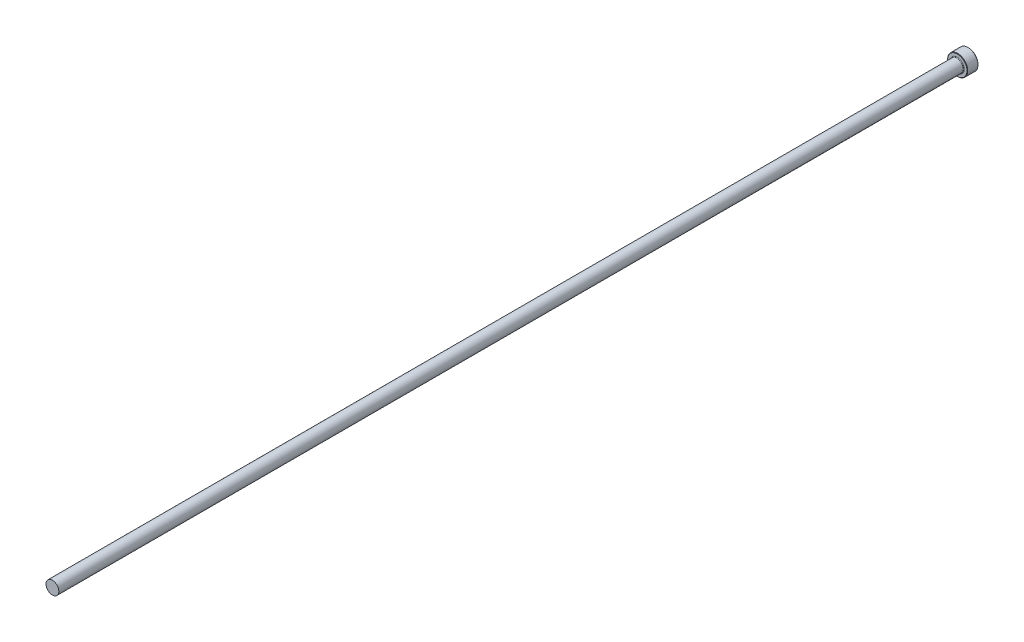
ISO-10303-21;
HEADER;
FILE_DESCRIPTION(('STEP AP214'),'2;1');
FILE_NAME('part.step','',(''),(''),'','','');
FILE_SCHEMA(('AUTOMOTIVE_DESIGN { 1 0 10303 214 1 1 1 1 }'));
ENDSEC;
DATA;
#1=APPLICATION_CONTEXT('core data for automotive mechanical design processes');
#2=APPLICATION_PROTOCOL_DEFINITION('international standard','automotive_design',2000,#1);
#3=PRODUCT_CONTEXT('',#1,'mechanical');
#4=PRODUCT('Part','Part','',(#3));
#5=PRODUCT_RELATED_PRODUCT_CATEGORY('part','',(#4));
#6=PRODUCT_DEFINITION_FORMATION('','',#4);
#7=PRODUCT_DEFINITION_CONTEXT('part definition',#1,'design');
#8=PRODUCT_DEFINITION('design','',#6,#7);
#9=PRODUCT_DEFINITION_SHAPE('','',#8);
#10=(LENGTH_UNIT() NAMED_UNIT(*) SI_UNIT(.MILLI.,.METRE.));
#11=(NAMED_UNIT(*) PLANE_ANGLE_UNIT() SI_UNIT($,.RADIAN.));
#12=(NAMED_UNIT(*) SI_UNIT($,.STERADIAN.) SOLID_ANGLE_UNIT());
#13=UNCERTAINTY_MEASURE_WITH_UNIT(LENGTH_MEASURE(1.E-05),#10,'distance_accuracy_value','');
#14=(GEOMETRIC_REPRESENTATION_CONTEXT(3) GLOBAL_UNCERTAINTY_ASSIGNED_CONTEXT((#13)) GLOBAL_UNIT_ASSIGNED_CONTEXT((#10,
#11,#12)) REPRESENTATION_CONTEXT('',''));
#15=CARTESIAN_POINT('',(0.,0.,0.));
#16=DIRECTION('',(0.,0.,1.));
#17=DIRECTION('',(1.,0.,0.));
#18=AXIS2_PLACEMENT_3D('',#15,#16,#17);
#19=CARTESIAN_POINT('',(0.,3.49999999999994,500.));
#20=DIRECTION('',(0.,0.,-1.));
#21=DIRECTION('',(-1.,0.,0.));
#22=AXIS2_PLACEMENT_3D('',#19,#20,#21);
#23=PLANE('',#22);
#24=CARTESIAN_POINT('',(0.,0.,500.));
#25=DIRECTION('',(0.,0.,1.));
#26=DIRECTION('',(1.,0.,0.));
#27=AXIS2_PLACEMENT_3D('',#24,#25,#26);
#28=CIRCLE('',#27,3.49999999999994);
#29=CARTESIAN_POINT('',(3.49999999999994,0.,500.));
#30=VERTEX_POINT('',#29);
#31=EDGE_CURVE('E50',#30,#30,#28,.T.);
#32=ORIENTED_EDGE('',*,*,#31,.T.);
#33=EDGE_LOOP('',(#32));
#34=FACE_BOUND('',#33,.T.);
#35=ADVANCED_FACE('F30',(#34),#23,.F.);
#36=CARTESIAN_POINT('',(0.,0.,109.050628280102));
#37=DIRECTION('',(0.,0.,1.));
#38=DIRECTION('',(1.,0.,0.));
#39=AXIS2_PLACEMENT_3D('',#36,#37,#38);
#40=CYLINDRICAL_SURFACE('',#39,3.49999999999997);
#41=ORIENTED_EDGE('',*,*,#31,.F.);
#42=EDGE_LOOP('',(#41));
#43=FACE_BOUND('',#42,.T.);
#44=CARTESIAN_POINT('',(0.,0.,6.3));
#45=DIRECTION('',(0.,0.,1.));
#46=DIRECTION('',(1.,0.,0.));
#47=AXIS2_PLACEMENT_3D('',#44,#45,#46);
#48=CIRCLE('',#47,3.5);
#49=CARTESIAN_POINT('',(3.5,0.,6.3));
#50=VERTEX_POINT('',#49);
#51=EDGE_CURVE('E53',#50,#50,#48,.T.);
#52=ORIENTED_EDGE('',*,*,#51,.T.);
#53=EDGE_LOOP('',(#52));
#54=FACE_BOUND('',#53,.T.);
#55=ADVANCED_FACE('F73',(#43,#54),#40,.T.);
#56=CARTESIAN_POINT('',(0.,0.,6.3));
#57=DIRECTION('',(0.,0.,1.));
#58=DIRECTION('',(1.,0.,0.));
#59=AXIS2_PLACEMENT_3D('',#56,#57,#58);
#60=TOROIDAL_SURFACE('',#59,3.8,0.3);
#61=ORIENTED_EDGE('',*,*,#51,.F.);
#62=EDGE_LOOP('',(#61));
#63=FACE_BOUND('',#62,.T.);
#64=CARTESIAN_POINT('',(0.,0.,6.00000000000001));
#65=DIRECTION('',(0.,0.,1.));
#66=DIRECTION('',(1.,0.,0.));
#67=AXIS2_PLACEMENT_3D('',#64,#65,#66);
#68=CIRCLE('',#67,3.8);
#69=CARTESIAN_POINT('',(3.8,0.,6.00000000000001));
#70=VERTEX_POINT('',#69);
#71=EDGE_CURVE('E56',#70,#70,#68,.T.);
#72=ORIENTED_EDGE('',*,*,#71,.T.);
#73=EDGE_LOOP('',(#72));
#74=FACE_BOUND('',#73,.T.);
#75=ADVANCED_FACE('F60',(#63,#74),#60,.F.);
#76=CARTESIAN_POINT('',(0.,5.5,6.));
#77=DIRECTION('',(0.,0.,-1.));
#78=DIRECTION('',(-1.,0.,0.));
#79=AXIS2_PLACEMENT_3D('',#76,#77,#78);
#80=PLANE('',#79);
#81=CARTESIAN_POINT('',(0.,0.,6.));
#82=DIRECTION('',(0.,0.,-1.));
#83=DIRECTION('',(-1.,0.,0.));
#84=AXIS2_PLACEMENT_3D('',#81,#82,#83);
#85=CIRCLE('',#84,5.30000000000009);
#86=CARTESIAN_POINT('',(-5.30000000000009,0.,6.));
#87=VERTEX_POINT('',#86);
#88=EDGE_CURVE('E10',#87,#87,#85,.F.);
#89=ORIENTED_EDGE('',*,*,#88,.T.);
#90=EDGE_LOOP('',(#89));
#91=FACE_BOUND('',#90,.T.);
#92=ORIENTED_EDGE('',*,*,#71,.F.);
#93=EDGE_LOOP('',(#92));
#94=FACE_BOUND('',#93,.T.);
#95=ADVANCED_FACE('F62',(#91,#94),#80,.F.);
#96=CARTESIAN_POINT('',(0.,0.,109.050628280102));
#97=DIRECTION('',(0.,0.,1.));
#98=DIRECTION('',(1.,0.,0.));
#99=AXIS2_PLACEMENT_3D('',#96,#97,#98);
#100=CYLINDRICAL_SURFACE('',#99,5.5);
#101=CARTESIAN_POINT('',(0.,0.,0.200000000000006));
#102=DIRECTION('',(0.,0.,1.));
#103=DIRECTION('',(1.,0.,0.));
#104=AXIS2_PLACEMENT_3D('',#101,#102,#103);
#105=CIRCLE('',#104,5.5);
#106=CARTESIAN_POINT('',(5.5,0.,0.200000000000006));
#107=VERTEX_POINT('',#106);
#108=EDGE_CURVE('E41',#107,#107,#105,.T.);
#109=ORIENTED_EDGE('',*,*,#108,.T.);
#110=EDGE_LOOP('',(#109));
#111=FACE_BOUND('',#110,.T.);
#112=CARTESIAN_POINT('',(0.,0.,5.80000000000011));
#113=DIRECTION('',(0.,0.,-1.));
#114=DIRECTION('',(-1.,0.,0.));
#115=AXIS2_PLACEMENT_3D('',#112,#113,#114);
#116=CIRCLE('',#115,5.5);
#117=CARTESIAN_POINT('',(-5.5,0.,5.80000000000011));
#118=VERTEX_POINT('',#117);
#119=EDGE_CURVE('E45',#118,#118,#116,.T.);
#120=ORIENTED_EDGE('',*,*,#119,.T.);
#121=EDGE_LOOP('',(#120));
#122=FACE_BOUND('',#121,.T.);
#123=ADVANCED_FACE('F64',(#111,#122),#100,.T.);
#124=CARTESIAN_POINT('',(0.,0.,0.));
#125=DIRECTION('',(0.,0.,1.));
#126=DIRECTION('',(1.,0.,0.));
#127=AXIS2_PLACEMENT_3D('',#124,#125,#126);
#128=PLANE('',#127);
#129=CARTESIAN_POINT('',(0.,0.,0.));
#130=DIRECTION('',(0.,0.,1.));
#131=DIRECTION('',(1.,0.,0.));
#132=AXIS2_PLACEMENT_3D('',#129,#130,#131);
#133=CIRCLE('',#132,5.30000000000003);
#134=CARTESIAN_POINT('',(5.30000000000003,0.,0.));
#135=VERTEX_POINT('',#134);
#136=EDGE_CURVE('E37',#135,#135,#133,.F.);
#137=ORIENTED_EDGE('',*,*,#136,.T.);
#138=EDGE_LOOP('',(#137));
#139=FACE_BOUND('',#138,.T.);
#140=ADVANCED_FACE('F70',(#139),#128,.F.);
#141=CARTESIAN_POINT('',(0.,0.,0.200000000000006));
#142=DIRECTION('',(0.,0.,1.));
#143=DIRECTION('',(1.,0.,0.));
#144=AXIS2_PLACEMENT_3D('',#141,#142,#143);
#145=CONICAL_SURFACE('',#144,5.5,0.785398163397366);
#146=ORIENTED_EDGE('',*,*,#136,.F.);
#147=EDGE_LOOP('',(#146));
#148=FACE_BOUND('',#147,.T.);
#149=ORIENTED_EDGE('',*,*,#108,.F.);
#150=EDGE_LOOP('',(#149));
#151=FACE_BOUND('',#150,.T.);
#152=ADVANCED_FACE('F84',(#148,#151),#145,.T.);
#153=CARTESIAN_POINT('',(0.,0.,6.00000000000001));
#154=DIRECTION('',(0.,0.,-1.));
#155=DIRECTION('',(-1.,0.,0.));
#156=AXIS2_PLACEMENT_3D('',#153,#154,#155);
#157=CONICAL_SURFACE('',#156,5.30000000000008,0.785398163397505);
#158=ORIENTED_EDGE('',*,*,#119,.F.);
#159=EDGE_LOOP('',(#158));
#160=FACE_BOUND('',#159,.T.);
#161=ORIENTED_EDGE('',*,*,#88,.F.);
#162=EDGE_LOOP('',(#161));
#163=FACE_BOUND('',#162,.T.);
#164=ADVANCED_FACE('F32',(#160,#163),#157,.T.);
#165=CLOSED_SHELL('',(#35,#55,#75,#95,#123,#140,#152,#164));
#166=MANIFOLD_SOLID_BREP('B2',#165);
#167=ADVANCED_BREP_SHAPE_REPRESENTATION('',(#18,#166),#14);
#168=SHAPE_DEFINITION_REPRESENTATION(#9,#167);
ENDSEC;
END-ISO-10303-21;
